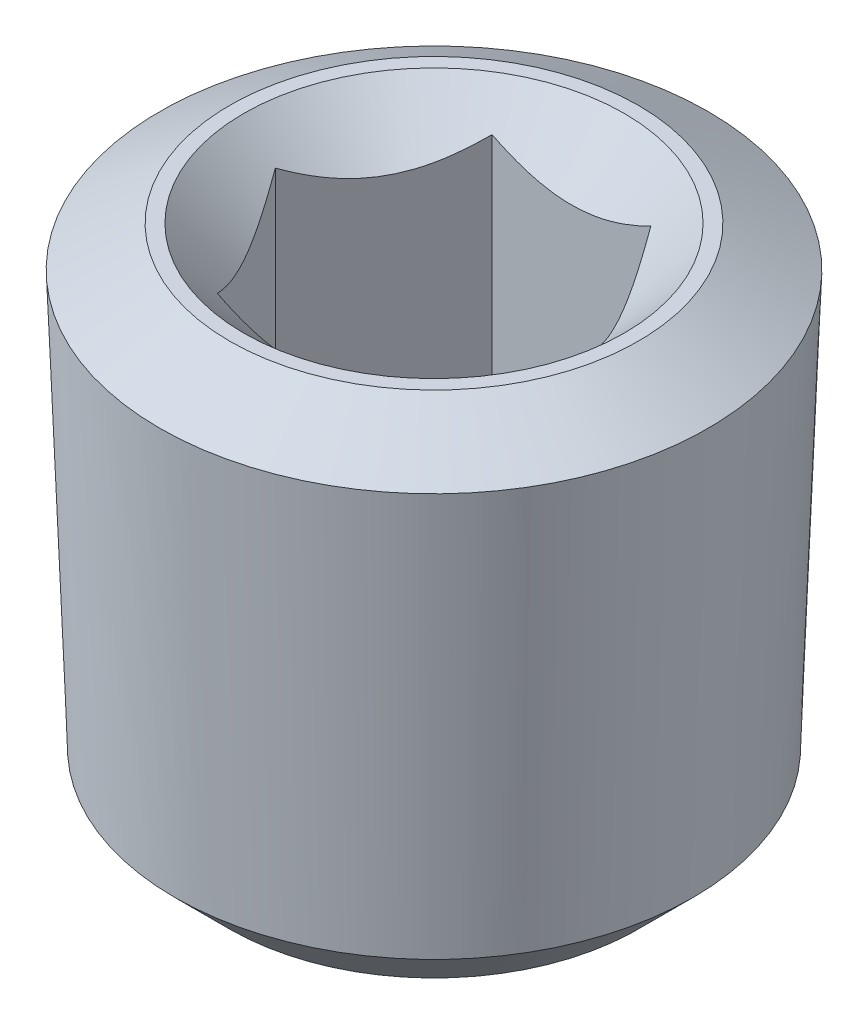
ISO-10303-21;
HEADER;
FILE_DESCRIPTION(('STEP AP214'),'2;1');
FILE_NAME('part.step','',(''),(''),'','','');
FILE_SCHEMA(('AUTOMOTIVE_DESIGN { 1 0 10303 214 1 1 1 1 }'));
ENDSEC;
DATA;
#1=APPLICATION_CONTEXT('core data for automotive mechanical design processes');
#2=APPLICATION_PROTOCOL_DEFINITION('international standard','automotive_design',2000,#1);
#3=PRODUCT_CONTEXT('',#1,'mechanical');
#4=PRODUCT('Part','Part','',(#3));
#5=PRODUCT_RELATED_PRODUCT_CATEGORY('part','',(#4));
#6=PRODUCT_DEFINITION_FORMATION('','',#4);
#7=PRODUCT_DEFINITION_CONTEXT('part definition',#1,'design');
#8=PRODUCT_DEFINITION('design','',#6,#7);
#9=PRODUCT_DEFINITION_SHAPE('','',#8);
#10=(LENGTH_UNIT() NAMED_UNIT(*) SI_UNIT(.MILLI.,.METRE.));
#11=(NAMED_UNIT(*) PLANE_ANGLE_UNIT() SI_UNIT($,.RADIAN.));
#12=(NAMED_UNIT(*) SI_UNIT($,.STERADIAN.) SOLID_ANGLE_UNIT());
#13=UNCERTAINTY_MEASURE_WITH_UNIT(LENGTH_MEASURE(1.E-05),#10,'distance_accuracy_value','');
#14=(GEOMETRIC_REPRESENTATION_CONTEXT(3) GLOBAL_UNCERTAINTY_ASSIGNED_CONTEXT((#13)) GLOBAL_UNIT_ASSIGNED_CONTEXT((#10,
#11,#12)) REPRESENTATION_CONTEXT('',''));
#15=CARTESIAN_POINT('',(0.,0.,0.));
#16=DIRECTION('',(0.,0.,1.));
#17=DIRECTION('',(1.,0.,0.));
#18=AXIS2_PLACEMENT_3D('',#15,#16,#17);
#19=CARTESIAN_POINT('',(0.,0.,0.));
#20=DIRECTION('',(0.,1.,0.));
#21=DIRECTION('',(0.,0.,1.));
#22=AXIS2_PLACEMENT_3D('',#19,#20,#21);
#23=PLANE('',#22);
#24=CARTESIAN_POINT('',(0.,0.,0.));
#25=DIRECTION('',(0.,1.,0.));
#26=DIRECTION('',(0.,0.,1.));
#27=AXIS2_PLACEMENT_3D('',#24,#25,#26);
#28=CIRCLE('',#27,2.7432);
#29=CARTESIAN_POINT('',(0.,0.,2.7432));
#30=VERTEX_POINT('',#29);
#31=EDGE_CURVE('E245',#30,#30,#28,.T.);
#32=ORIENTED_EDGE('',*,*,#31,.F.);
#33=EDGE_LOOP('',(#32));
#34=FACE_BOUND('',#33,.T.);
#35=CARTESIAN_POINT('',(0.,0.,0.));
#36=DIRECTION('',(0.,1.,0.));
#37=DIRECTION('',(0.,0.,1.));
#38=AXIS2_PLACEMENT_3D('',#35,#36,#37);
#39=CIRCLE('',#38,2.94547188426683);
#40=CARTESIAN_POINT('',(0.,0.,2.94547188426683));
#41=VERTEX_POINT('',#40);
#42=EDGE_CURVE('E12',#41,#41,#39,.T.);
#43=ORIENTED_EDGE('',*,*,#42,.T.);
#44=EDGE_LOOP('',(#43));
#45=FACE_BOUND('',#44,.T.);
#46=ADVANCED_FACE('F34',(#34,#45),#23,.T.);
#47=CARTESIAN_POINT('',(0.,0.,0.));
#48=DIRECTION('',(0.,-1.,0.));
#49=DIRECTION('',(0.,0.,-1.));
#50=AXIS2_PLACEMENT_3D('',#47,#48,#49);
#51=CONICAL_SURFACE('',#50,2.94547188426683,1.0471975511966);
#52=CARTESIAN_POINT('',(0.,-0.58220109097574,0.));
#53=DIRECTION('',(0.,1.,0.));
#54=DIRECTION('',(0.,0.,1.));
#55=AXIS2_PLACEMENT_3D('',#52,#53,#54);
#56=CIRCLE('',#55,3.95387375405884);
#57=CARTESIAN_POINT('',(0.,-0.58220109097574,3.95387375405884));
#58=VERTEX_POINT('',#57);
#59=EDGE_CURVE('E41',#58,#58,#56,.T.);
#60=ORIENTED_EDGE('',*,*,#59,.T.);
#61=EDGE_LOOP('',(#60));
#62=FACE_BOUND('',#61,.T.);
#63=ORIENTED_EDGE('',*,*,#42,.F.);
#64=EDGE_LOOP('',(#63));
#65=FACE_BOUND('',#64,.T.);
#66=ADVANCED_FACE('F235',(#62,#65),#51,.T.);
#67=CARTESIAN_POINT('',(0.,-0.58220109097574,0.));
#68=DIRECTION('',(0.,1.,0.));
#69=DIRECTION('',(0.,0.,1.));
#70=AXIS2_PLACEMENT_3D('',#67,#68,#69);
#71=CONICAL_SURFACE('',#70,3.95387375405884,0.0364424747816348);
#72=CARTESIAN_POINT('',(0.,-6.54976733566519,0.));
#73=DIRECTION('',(0.,1.,0.));
#74=DIRECTION('',(0.,0.,1.));
#75=AXIS2_PLACEMENT_3D('',#72,#73,#74);
#76=CIRCLE('',#75,3.73630454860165);
#77=CARTESIAN_POINT('',(0.,-6.54976733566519,3.73630454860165));
#78=VERTEX_POINT('',#77);
#79=EDGE_CURVE('E253',#78,#78,#76,.T.);
#80=ORIENTED_EDGE('',*,*,#79,.T.);
#81=EDGE_LOOP('',(#80));
#82=FACE_BOUND('',#81,.T.);
#83=ORIENTED_EDGE('',*,*,#59,.F.);
#84=EDGE_LOOP('',(#83));
#85=FACE_BOUND('',#84,.T.);
#86=ADVANCED_FACE('F240',(#82,#85),#71,.T.);
#87=CARTESIAN_POINT('',(0.,-6.54976733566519,0.));
#88=DIRECTION('',(0.,1.,0.));
#89=DIRECTION('',(0.,0.,1.));
#90=AXIS2_PLACEMENT_3D('',#87,#88,#89);
#91=CONICAL_SURFACE('',#90,3.73630454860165,0.785398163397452);
#92=CARTESIAN_POINT('',(0.,-7.3406,0.));
#93=DIRECTION('',(0.,1.,0.));
#94=DIRECTION('',(0.,0.,1.));
#95=AXIS2_PLACEMENT_3D('',#92,#93,#94);
#96=CIRCLE('',#95,2.94547188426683);
#97=CARTESIAN_POINT('',(0.,-7.3406,2.94547188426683));
#98=VERTEX_POINT('',#97);
#99=EDGE_CURVE('E249',#98,#98,#96,.T.);
#100=ORIENTED_EDGE('',*,*,#99,.T.);
#101=EDGE_LOOP('',(#100));
#102=FACE_BOUND('',#101,.T.);
#103=ORIENTED_EDGE('',*,*,#79,.F.);
#104=EDGE_LOOP('',(#103));
#105=FACE_BOUND('',#104,.T.);
#106=ADVANCED_FACE('F264',(#102,#105),#91,.T.);
#107=CARTESIAN_POINT('',(-2.94547188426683,-7.3406,0.));
#108=DIRECTION('',(0.,-1.,0.));
#109=DIRECTION('',(0.,0.,-1.));
#110=AXIS2_PLACEMENT_3D('',#107,#108,#109);
#111=PLANE('',#110);
#112=ORIENTED_EDGE('',*,*,#99,.F.);
#113=EDGE_LOOP('',(#112));
#114=FACE_BOUND('',#113,.T.);
#115=ADVANCED_FACE('F178',(#114),#111,.T.);
#116=CARTESIAN_POINT('',(0.,0.,0.));
#117=DIRECTION('',(0.,1.,0.));
#118=DIRECTION('',(0.,0.,1.));
#119=AXIS2_PLACEMENT_3D('',#116,#117,#118);
#120=CONICAL_SURFACE('',#119,2.7432,0.785398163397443);
#121=CARTESIAN_POINT('',(-2.57510355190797,0.50584782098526,1.9812));
#122=CARTESIAN_POINT('',(-2.51354578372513,0.457069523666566,1.9812));
#123=CARTESIAN_POINT('',(-2.45167860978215,0.408675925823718,1.9812));
#124=CARTESIAN_POINT('',(-2.32719174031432,0.312839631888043,1.9812));
#125=CARTESIAN_POINT('',(-2.26457188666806,0.265397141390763,1.9812));
#126=CARTESIAN_POINT('',(-2.13799293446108,0.171309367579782,1.9812));
#127=CARTESIAN_POINT('',(-2.07402727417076,0.124672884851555,1.9812));
#128=CARTESIAN_POINT('',(-1.94507265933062,0.03284224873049,1.9812));
#129=CARTESIAN_POINT('',(-1.88008377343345,-0.0123520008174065,1.9812));
#130=CARTESIAN_POINT('',(-1.74397621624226,-0.10427974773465,1.9812));
#131=CARTESIAN_POINT('',(-1.67276336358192,-0.150874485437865,1.9812));
#132=CARTESIAN_POINT('',(-1.52868136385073,-0.241424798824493,1.9812));
#133=CARTESIAN_POINT('',(-1.45581242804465,-0.285380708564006,1.9812));
#134=CARTESIAN_POINT('',(-1.30832056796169,-0.369762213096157,1.9812));
#135=CARTESIAN_POINT('',(-1.23370327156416,-0.410197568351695,1.9812));
#136=CARTESIAN_POINT('',(-1.08224421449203,-0.486624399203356,1.9812));
#137=CARTESIAN_POINT('',(-1.00540359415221,-0.522618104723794,1.9812));
#138=CARTESIAN_POINT('',(-0.859075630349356,-0.584647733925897,1.9812));
#139=CARTESIAN_POINT('',(-0.789880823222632,-0.611366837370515,1.9812));
#140=CARTESIAN_POINT('',(-0.649566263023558,-0.659274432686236,1.9812));
#141=CARTESIAN_POINT('',(-0.578446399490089,-0.68046260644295,1.9812));
#142=CARTESIAN_POINT('',(-0.436050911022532,-0.715727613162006,1.9812));
#143=CARTESIAN_POINT('',(-0.36481123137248,-0.729947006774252,1.9812));
#144=CARTESIAN_POINT('',(-0.221237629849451,-0.750948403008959,1.9812));
#145=CARTESIAN_POINT('',(-0.14890402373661,-0.757732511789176,1.9812));
#146=CARTESIAN_POINT('',(-0.00820637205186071,-0.76315624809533,1.9812));
#147=CARTESIAN_POINT('',(0.0601400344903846,-0.762252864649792,1.9812));
#148=CARTESIAN_POINT('',(0.196377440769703,-0.753452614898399,1.9812));
#149=CARTESIAN_POINT('',(0.264268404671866,-0.745555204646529,1.9812));
#150=CARTESIAN_POINT('',(0.400266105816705,-0.723106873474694,1.9812));
#151=CARTESIAN_POINT('',(0.468351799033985,-0.708430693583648,1.9812));
#152=CARTESIAN_POINT('',(0.602982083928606,-0.673292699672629,1.9812));
#153=CARTESIAN_POINT('',(0.669526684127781,-0.652830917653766,1.9812));
#154=CARTESIAN_POINT('',(0.867724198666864,-0.583887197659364,1.9812));
#155=CARTESIAN_POINT('',(0.996810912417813,-0.528063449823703,1.9812));
#156=CARTESIAN_POINT('',(1.2489899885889,-0.403752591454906,1.9812));
#157=CARTESIAN_POINT('',(1.3720599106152,-0.335222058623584,1.9812));
#158=CARTESIAN_POINT('',(1.54997195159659,-0.228144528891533,1.9812));
#159=CARTESIAN_POINT('',(1.60673701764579,-0.192728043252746,1.9812));
#160=CARTESIAN_POINT('',(1.71929230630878,-0.12036693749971,1.9812));
#161=CARTESIAN_POINT('',(1.77508245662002,-0.0834222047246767,1.9812));
#162=CARTESIAN_POINT('',(1.88537126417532,-0.00857930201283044,1.9812));
#163=CARTESIAN_POINT('',(1.93987664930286,0.0293090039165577,1.9812));
#164=CARTESIAN_POINT('',(2.04813768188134,0.106112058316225,1.9812));
#165=CARTESIAN_POINT('',(2.10189353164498,0.145026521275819,1.9812));
#166=CARTESIAN_POINT('',(2.15533457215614,0.184362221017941,1.9812));
#167=B_SPLINE_CURVE_WITH_KNOTS('',3,(#121,#122,#123,#124,#125,#126,#127,#128,#129,#130,#131,
#132,#133,#134,#135,#136,#137,#138,#139,#140,#141,#142,#143,#144,#145,#146,#147,#148,#149,#150,
#151,#152,#153,#154,#155,#156,#157,#158,#159,#160,#161,#162,#163,#164,#165,#166),.UNSPECIFIED.,
.F.,.F.,(4,2,2,2,2,2,2,2,2,2,2,2,2,2,2,2,2,2,2,2,2,2,4),(0.,0.235626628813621,0.471303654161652,
0.708772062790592,0.946224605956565,1.20148543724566,1.4567138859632,1.71121056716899,
1.9655789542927,2.18791541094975,2.41026465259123,2.62785270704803,2.84537911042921,
3.05006908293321,3.25477497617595,3.46342485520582,3.67207358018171,4.09278433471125,
4.51496018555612,4.71566341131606,4.91638145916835,5.11551042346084,5.31458455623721),.UNSPECIFIED.);
#168=CARTESIAN_POINT('',(1.14384635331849,-0.455507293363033,1.9812));
#169=VERTEX_POINT('',#168);
#170=CARTESIAN_POINT('',(-1.14384635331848,-0.455507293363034,1.9812));
#171=VERTEX_POINT('',#170);
#172=EDGE_CURVE('E48',#169,#171,#167,.F.);
#173=ORIENTED_EDGE('',*,*,#172,.T.);
#174=CARTESIAN_POINT('',(-1.14373088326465,-0.455391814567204,1.9814));
#175=CARTESIAN_POINT('',(-1.18305240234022,-0.494681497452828,1.91329313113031));
#176=CARTESIAN_POINT('',(-1.22303144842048,-0.531663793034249,1.84404739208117));
#177=CARTESIAN_POINT('',(-1.30455323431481,-0.599377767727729,1.70284751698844));
#178=CARTESIAN_POINT('',(-1.34610372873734,-0.630071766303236,1.63087994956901));
#179=CARTESIAN_POINT('',(-1.4298883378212,-0.682651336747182,1.48576074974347));
#180=CARTESIAN_POINT('',(-1.47210111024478,-0.704669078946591,1.41264608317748));
#181=CARTESIAN_POINT('',(-1.55745605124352,-0.738592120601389,1.26480698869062));
#182=CARTESIAN_POINT('',(-1.60059561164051,-0.750522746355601,1.19008707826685));
#183=CARTESIAN_POINT('',(-1.67494288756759,-0.761287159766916,1.0613138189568));
#184=CARTESIAN_POINT('',(-1.70605452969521,-0.762880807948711,1.00742687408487));
#185=CARTESIAN_POINT('',(-1.76822697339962,-0.760197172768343,0.899741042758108));
#186=CARTESIAN_POINT('',(-1.7992877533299,-0.755917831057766,0.845942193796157));
#187=CARTESIAN_POINT('',(-1.86111604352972,-0.741731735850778,0.738852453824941));
#188=CARTESIAN_POINT('',(-1.8918831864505,-0.731818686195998,0.685562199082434));
#189=CARTESIAN_POINT('',(-1.95288543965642,-0.706909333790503,0.579903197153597));
#190=CARTESIAN_POINT('',(-1.98312059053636,-0.691913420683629,0.527534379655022));
#191=CARTESIAN_POINT('',(-2.06057049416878,-0.647391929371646,0.393387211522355));
#192=CARTESIAN_POINT('',(-2.10730489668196,-0.6145094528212,0.312440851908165));
#193=CARTESIAN_POINT('',(-2.17602360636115,-0.558998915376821,0.19341655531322));
#194=CARTESIAN_POINT('',(-2.19866947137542,-0.539495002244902,0.154192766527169));
#195=CARTESIAN_POINT('',(-2.24354167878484,-0.498709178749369,0.0764718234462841));
#196=CARTESIAN_POINT('',(-2.26576826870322,-0.477428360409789,0.0379742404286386));
#197=CARTESIAN_POINT('',(-2.28780817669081,-0.455391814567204,-0.000200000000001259));
#198=B_SPLINE_CURVE_WITH_KNOTS('',3,(#174,#175,#176,#177,#178,#179,#180,#181,#182,#183,#184,
#185,#186,#187,#188,#189,#190,#191,#192,#193,#194,#195,#196,#197),.UNSPECIFIED.,.F.,.F.,(4,2,2,
2,2,2,2,2,2,2,2,4),(0.,0.263916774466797,0.529371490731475,0.79060967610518,1.05118999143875,
1.23765676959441,1.42418891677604,1.61092994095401,1.79765665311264,2.09428646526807,
2.24219924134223,2.39002177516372),.UNSPECIFIED.);
#199=CARTESIAN_POINT('',(-2.28769270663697,-0.455507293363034,0.));
#200=VERTEX_POINT('',#199);
#201=EDGE_CURVE('E120',#171,#200,#198,.T.);
#202=ORIENTED_EDGE('',*,*,#201,.T.);
#203=CARTESIAN_POINT('',(-2.28780817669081,-0.455391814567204,0.000199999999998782));
#204=CARTESIAN_POINT('',(-2.24848665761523,-0.494681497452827,-0.0679068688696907));
#205=CARTESIAN_POINT('',(-2.20850761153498,-0.531663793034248,-0.137152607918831));
#206=CARTESIAN_POINT('',(-2.12698582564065,-0.599377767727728,-0.278352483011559));
#207=CARTESIAN_POINT('',(-2.08543533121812,-0.630071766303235,-0.350320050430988));
#208=CARTESIAN_POINT('',(-2.00165072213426,-0.682651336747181,-0.495439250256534));
#209=CARTESIAN_POINT('',(-1.95943794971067,-0.704669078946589,-0.568553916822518));
#210=CARTESIAN_POINT('',(-1.87408300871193,-0.738592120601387,-0.71639301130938));
#211=CARTESIAN_POINT('',(-1.83094344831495,-0.7505227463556,-0.791112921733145));
#212=CARTESIAN_POINT('',(-1.75659617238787,-0.761287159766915,-0.919886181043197));
#213=CARTESIAN_POINT('',(-1.72548453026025,-0.762880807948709,-0.973773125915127));
#214=CARTESIAN_POINT('',(-1.66331208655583,-0.760197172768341,-1.08145895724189));
#215=CARTESIAN_POINT('',(-1.63225130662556,-0.755917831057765,-1.13525780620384));
#216=CARTESIAN_POINT('',(-1.57042301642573,-0.741731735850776,-1.24234754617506));
#217=CARTESIAN_POINT('',(-1.53965587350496,-0.731818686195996,-1.29563780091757));
#218=CARTESIAN_POINT('',(-1.47865362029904,-0.706909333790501,-1.4012968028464));
#219=CARTESIAN_POINT('',(-1.4484184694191,-0.691913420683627,-1.45366562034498));
#220=CARTESIAN_POINT('',(-1.37096856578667,-0.647391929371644,-1.58781278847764));
#221=CARTESIAN_POINT('',(-1.3242341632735,-0.614509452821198,-1.66875914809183));
#222=CARTESIAN_POINT('',(-1.2555154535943,-0.55899891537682,-1.78778344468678));
#223=CARTESIAN_POINT('',(-1.23286958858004,-0.5394950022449,-1.82700723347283));
#224=CARTESIAN_POINT('',(-1.18799738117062,-0.498709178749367,-1.90472817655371));
#225=CARTESIAN_POINT('',(-1.16577079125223,-0.477428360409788,-1.94322575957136));
#226=CARTESIAN_POINT('',(-1.14373088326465,-0.455391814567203,-1.9814));
#227=B_SPLINE_CURVE_WITH_KNOTS('',3,(#203,#204,#205,#206,#207,#208,#209,#210,#211,#212,#213,
#214,#215,#216,#217,#218,#219,#220,#221,#222,#223,#224,#225,#226),.UNSPECIFIED.,.F.,.F.,(4,2,2,
2,2,2,2,2,2,2,2,4),(0.,0.263916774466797,0.529371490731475,0.790609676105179,1.05118999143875,
1.23765676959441,1.42418891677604,1.61092994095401,1.79765665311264,2.09428646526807,
2.24219924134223,2.39002177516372),.UNSPECIFIED.);
#228=CARTESIAN_POINT('',(-1.14384635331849,-0.455507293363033,-1.9812));
#229=VERTEX_POINT('',#228);
#230=EDGE_CURVE('E202',#200,#229,#227,.T.);
#231=ORIENTED_EDGE('',*,*,#230,.T.);
#232=CARTESIAN_POINT('',(-2.57510355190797,0.505847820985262,-1.9812));
#233=CARTESIAN_POINT('',(-2.51354578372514,0.457069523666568,-1.9812));
#234=CARTESIAN_POINT('',(-2.45167860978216,0.40867592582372,-1.9812));
#235=CARTESIAN_POINT('',(-2.32719174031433,0.312839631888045,-1.9812));
#236=CARTESIAN_POINT('',(-2.26457188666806,0.265397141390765,-1.9812));
#237=CARTESIAN_POINT('',(-2.13799293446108,0.171309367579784,-1.9812));
#238=CARTESIAN_POINT('',(-2.07402727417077,0.124672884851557,-1.9812));
#239=CARTESIAN_POINT('',(-1.94507265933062,0.0328422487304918,-1.9812));
#240=CARTESIAN_POINT('',(-1.88008377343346,-0.0123520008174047,-1.9812));
#241=CARTESIAN_POINT('',(-1.74397621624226,-0.104279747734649,-1.9812));
#242=CARTESIAN_POINT('',(-1.67276336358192,-0.150874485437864,-1.9812));
#243=CARTESIAN_POINT('',(-1.52868136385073,-0.241424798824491,-1.9812));
#244=CARTESIAN_POINT('',(-1.45581242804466,-0.285380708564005,-1.9812));
#245=CARTESIAN_POINT('',(-1.30832056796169,-0.369762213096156,-1.9812));
#246=CARTESIAN_POINT('',(-1.23370327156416,-0.410197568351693,-1.9812));
#247=CARTESIAN_POINT('',(-1.08224421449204,-0.486624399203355,-1.9812));
#248=CARTESIAN_POINT('',(-1.00540359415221,-0.522618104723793,-1.9812));
#249=CARTESIAN_POINT('',(-0.859075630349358,-0.584647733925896,-1.9812));
#250=CARTESIAN_POINT('',(-0.789880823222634,-0.611366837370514,-1.9812));
#251=CARTESIAN_POINT('',(-0.649566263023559,-0.659274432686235,-1.9812));
#252=CARTESIAN_POINT('',(-0.57844639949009,-0.68046260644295,-1.9812));
#253=CARTESIAN_POINT('',(-0.436050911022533,-0.715727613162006,-1.9812));
#254=CARTESIAN_POINT('',(-0.364811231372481,-0.729947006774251,-1.9812));
#255=CARTESIAN_POINT('',(-0.221237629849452,-0.750948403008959,-1.9812));
#256=CARTESIAN_POINT('',(-0.148904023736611,-0.757732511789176,-1.9812));
#257=CARTESIAN_POINT('',(-0.00820637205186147,-0.76315624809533,-1.9812));
#258=CARTESIAN_POINT('',(0.060140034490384,-0.762252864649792,-1.9812));
#259=CARTESIAN_POINT('',(0.196377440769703,-0.753452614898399,-1.9812));
#260=CARTESIAN_POINT('',(0.264268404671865,-0.745555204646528,-1.9812));
#261=CARTESIAN_POINT('',(0.400266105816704,-0.723106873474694,-1.9812));
#262=CARTESIAN_POINT('',(0.468351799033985,-0.708430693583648,-1.9812));
#263=CARTESIAN_POINT('',(0.602982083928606,-0.673292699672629,-1.9812));
#264=CARTESIAN_POINT('',(0.669526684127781,-0.652830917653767,-1.9812));
#265=CARTESIAN_POINT('',(0.867724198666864,-0.583887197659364,-1.9812));
#266=CARTESIAN_POINT('',(0.996810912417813,-0.528063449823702,-1.9812));
#267=CARTESIAN_POINT('',(1.2489899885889,-0.403752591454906,-1.9812));
#268=CARTESIAN_POINT('',(1.3720599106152,-0.335222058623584,-1.9812));
#269=CARTESIAN_POINT('',(1.54997195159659,-0.228144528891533,-1.9812));
#270=CARTESIAN_POINT('',(1.60673701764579,-0.192728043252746,-1.9812));
#271=CARTESIAN_POINT('',(1.71929230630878,-0.120366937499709,-1.9812));
#272=CARTESIAN_POINT('',(1.77508245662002,-0.0834222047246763,-1.9812));
#273=CARTESIAN_POINT('',(1.88537126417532,-0.00857930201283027,-1.9812));
#274=CARTESIAN_POINT('',(1.93987664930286,0.0293090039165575,-1.9812));
#275=CARTESIAN_POINT('',(2.04813768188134,0.106112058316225,-1.9812));
#276=CARTESIAN_POINT('',(2.10189353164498,0.145026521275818,-1.9812));
#277=CARTESIAN_POINT('',(2.15533457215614,0.18436222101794,-1.9812));
#278=B_SPLINE_CURVE_WITH_KNOTS('',3,(#232,#233,#234,#235,#236,#237,#238,#239,#240,#241,#242,
#243,#244,#245,#246,#247,#248,#249,#250,#251,#252,#253,#254,#255,#256,#257,#258,#259,#260,#261,
#262,#263,#264,#265,#266,#267,#268,#269,#270,#271,#272,#273,#274,#275,#276,#277),.UNSPECIFIED.,
.F.,.F.,(4,2,2,2,2,2,2,2,2,2,2,2,2,2,2,2,2,2,2,2,2,2,4),(0.,0.235626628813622,0.471303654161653,
0.708772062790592,0.946224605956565,1.20148543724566,1.4567138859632,1.71121056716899,
1.96557895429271,2.18791541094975,2.41026465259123,2.62785270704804,2.84537911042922,
3.05006908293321,3.25477497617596,3.46342485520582,3.67207358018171,4.09278433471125,
4.51496018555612,4.71566341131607,4.91638145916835,5.11551042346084,5.31458455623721),.UNSPECIFIED.);
#279=CARTESIAN_POINT('',(1.14384635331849,-0.455507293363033,-1.9812));
#280=VERTEX_POINT('',#279);
#281=EDGE_CURVE('E195',#229,#280,#278,.T.);
#282=ORIENTED_EDGE('',*,*,#281,.T.);
#283=CARTESIAN_POINT('',(1.14373088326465,-0.455391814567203,-1.9814));
#284=CARTESIAN_POINT('',(1.18305240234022,-0.494681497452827,-1.91329313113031));
#285=CARTESIAN_POINT('',(1.22303144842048,-0.531663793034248,-1.84404739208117));
#286=CARTESIAN_POINT('',(1.30455323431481,-0.599377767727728,-1.70284751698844));
#287=CARTESIAN_POINT('',(1.34610372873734,-0.630071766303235,-1.63087994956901));
#288=CARTESIAN_POINT('',(1.4298883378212,-0.682651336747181,-1.48576074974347));
#289=CARTESIAN_POINT('',(1.47210111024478,-0.704669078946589,-1.41264608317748));
#290=CARTESIAN_POINT('',(1.55745605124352,-0.738592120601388,-1.26480698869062));
#291=CARTESIAN_POINT('',(1.60059561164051,-0.7505227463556,-1.19008707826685));
#292=CARTESIAN_POINT('',(1.67494288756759,-0.761287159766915,-1.0613138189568));
#293=CARTESIAN_POINT('',(1.70605452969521,-0.762880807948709,-1.00742687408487));
#294=CARTESIAN_POINT('',(1.76822697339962,-0.760197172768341,-0.899741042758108));
#295=CARTESIAN_POINT('',(1.7992877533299,-0.755917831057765,-0.845942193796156));
#296=CARTESIAN_POINT('',(1.86111604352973,-0.741731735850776,-0.73885245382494));
#297=CARTESIAN_POINT('',(1.8918831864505,-0.731818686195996,-0.685562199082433));
#298=CARTESIAN_POINT('',(1.95288543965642,-0.706909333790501,-0.579903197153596));
#299=CARTESIAN_POINT('',(1.98312059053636,-0.691913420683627,-0.527534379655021));
#300=CARTESIAN_POINT('',(2.06057049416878,-0.647391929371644,-0.393387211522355));
#301=CARTESIAN_POINT('',(2.10730489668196,-0.614509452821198,-0.312440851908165));
#302=CARTESIAN_POINT('',(2.17602360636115,-0.55899891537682,-0.193416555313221));
#303=CARTESIAN_POINT('',(2.19866947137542,-0.539495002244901,-0.154192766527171));
#304=CARTESIAN_POINT('',(2.24354167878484,-0.498709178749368,-0.0764718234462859));
#305=CARTESIAN_POINT('',(2.26576826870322,-0.477428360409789,-0.0379742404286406));
#306=CARTESIAN_POINT('',(2.28780817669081,-0.455391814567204,0.000199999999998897));
#307=B_SPLINE_CURVE_WITH_KNOTS('',3,(#283,#284,#285,#286,#287,#288,#289,#290,#291,#292,#293,
#294,#295,#296,#297,#298,#299,#300,#301,#302,#303,#304,#305,#306),.UNSPECIFIED.,.F.,.F.,(4,2,2,
2,2,2,2,2,2,2,2,4),(0.,0.263916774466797,0.529371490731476,0.790609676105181,1.05118999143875,
1.23765676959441,1.42418891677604,1.61092994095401,1.79765665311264,2.09428646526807,
2.24219924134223,2.39002177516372),.UNSPECIFIED.);
#308=CARTESIAN_POINT('',(2.28769270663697,-0.455507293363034,0.));
#309=VERTEX_POINT('',#308);
#310=EDGE_CURVE('E188',#280,#309,#307,.T.);
#311=ORIENTED_EDGE('',*,*,#310,.T.);
#312=CARTESIAN_POINT('',(2.28780817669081,-0.455391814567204,-0.0002000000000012));
#313=CARTESIAN_POINT('',(2.24848665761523,-0.494681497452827,0.0679068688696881));
#314=CARTESIAN_POINT('',(2.20850761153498,-0.531663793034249,0.137152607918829));
#315=CARTESIAN_POINT('',(2.12698582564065,-0.599377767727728,0.278352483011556));
#316=CARTESIAN_POINT('',(2.08543533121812,-0.630071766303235,0.350320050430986));
#317=CARTESIAN_POINT('',(2.00165072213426,-0.682651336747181,0.495439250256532));
#318=CARTESIAN_POINT('',(1.95943794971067,-0.70466907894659,0.568553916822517));
#319=CARTESIAN_POINT('',(1.87408300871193,-0.738592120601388,0.716393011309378));
#320=CARTESIAN_POINT('',(1.83094344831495,-0.7505227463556,0.791112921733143));
#321=CARTESIAN_POINT('',(1.75659617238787,-0.761287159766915,0.919886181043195));
#322=CARTESIAN_POINT('',(1.72548453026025,-0.76288080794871,0.973773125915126));
#323=CARTESIAN_POINT('',(1.66331208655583,-0.760197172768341,1.08145895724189));
#324=CARTESIAN_POINT('',(1.63225130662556,-0.755917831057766,1.13525780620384));
#325=CARTESIAN_POINT('',(1.57042301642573,-0.741731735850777,1.24234754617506));
#326=CARTESIAN_POINT('',(1.53965587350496,-0.731818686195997,1.29563780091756));
#327=CARTESIAN_POINT('',(1.47865362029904,-0.706909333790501,1.4012968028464));
#328=CARTESIAN_POINT('',(1.44841846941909,-0.691913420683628,1.45366562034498));
#329=CARTESIAN_POINT('',(1.37096856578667,-0.647391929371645,1.58781278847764));
#330=CARTESIAN_POINT('',(1.3242341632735,-0.614509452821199,1.66875914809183));
#331=CARTESIAN_POINT('',(1.2555154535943,-0.558998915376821,1.78778344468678));
#332=CARTESIAN_POINT('',(1.23286958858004,-0.539495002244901,1.82700723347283));
#333=CARTESIAN_POINT('',(1.18799738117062,-0.498709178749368,1.90472817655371));
#334=CARTESIAN_POINT('',(1.16577079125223,-0.477428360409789,1.94322575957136));
#335=CARTESIAN_POINT('',(1.14373088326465,-0.455391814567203,1.9814));
#336=B_SPLINE_CURVE_WITH_KNOTS('',3,(#312,#313,#314,#315,#316,#317,#318,#319,#320,#321,#322,
#323,#324,#325,#326,#327,#328,#329,#330,#331,#332,#333,#334,#335),.UNSPECIFIED.,.F.,.F.,(4,2,2,
2,2,2,2,2,2,2,2,4),(0.,0.263916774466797,0.529371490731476,0.79060967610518,1.05118999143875,
1.23765676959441,1.42418891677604,1.61092994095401,1.79765665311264,2.09428646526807,
2.24219924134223,2.39002177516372),.UNSPECIFIED.);
#337=EDGE_CURVE('E164',#309,#169,#336,.T.);
#338=ORIENTED_EDGE('',*,*,#337,.T.);
#339=EDGE_LOOP('',(#173,#202,#231,#282,#311,#338));
#340=FACE_BOUND('',#339,.T.);
#341=ORIENTED_EDGE('',*,*,#31,.T.);
#342=EDGE_LOOP('',(#341));
#343=FACE_BOUND('',#342,.T.);
#344=ADVANCED_FACE('F173',(#340,#343),#120,.F.);
#345=CARTESIAN_POINT('',(-2.28769270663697,-6.096,0.));
#346=DIRECTION('',(-0.866025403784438,0.,0.5));
#347=DIRECTION('',(0.5,0.,0.866025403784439));
#348=AXIS2_PLACEMENT_3D('',#345,#346,#347);
#349=PLANE('',#348);
#350=DIRECTION('',(0.,1.,0.));
#351=VECTOR('',#350,1.);
#352=CARTESIAN_POINT('',(-1.14384635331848,-6.096,1.9812));
#353=LINE('',#352,#351);
#354=CARTESIAN_POINT('',(-1.14384635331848,-6.096,1.9812));
#355=VERTEX_POINT('',#354);
#356=EDGE_CURVE('E117',#355,#171,#353,.T.);
#357=ORIENTED_EDGE('',*,*,#356,.F.);
#358=DIRECTION('',(0.5,0.,0.866025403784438));
#359=VECTOR('',#358,1.);
#360=CARTESIAN_POINT('',(-2.28769270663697,-6.096,0.));
#361=LINE('',#360,#359);
#362=CARTESIAN_POINT('',(-1.71576952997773,-6.096,0.990599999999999));
#363=VERTEX_POINT('',#362);
#364=EDGE_CURVE('E104',#363,#355,#361,.T.);
#365=ORIENTED_EDGE('',*,*,#364,.F.);
#366=CARTESIAN_POINT('',(-2.28769270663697,-6.096,0.));
#367=VERTEX_POINT('',#366);
#368=EDGE_CURVE('E114',#367,#363,#361,.T.);
#369=ORIENTED_EDGE('',*,*,#368,.F.);
#370=DIRECTION('',(0.,1.,0.));
#371=VECTOR('',#370,1.);
#372=CARTESIAN_POINT('',(-2.28769270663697,-6.096,0.));
#373=LINE('',#372,#371);
#374=EDGE_CURVE('E144',#367,#200,#373,.T.);
#375=ORIENTED_EDGE('',*,*,#374,.T.);
#376=ORIENTED_EDGE('',*,*,#201,.F.);
#377=EDGE_LOOP('',(#357,#365,#369,#375,#376));
#378=FACE_BOUND('',#377,.T.);
#379=ADVANCED_FACE('F118',(#378),#349,.F.);
#380=CARTESIAN_POINT('',(-1.14384635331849,-6.096,-1.9812));
#381=DIRECTION('',(-0.866025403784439,0.,-0.5));
#382=DIRECTION('',(-0.5,0.,0.866025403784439));
#383=AXIS2_PLACEMENT_3D('',#380,#381,#382);
#384=PLANE('',#383);
#385=ORIENTED_EDGE('',*,*,#374,.F.);
#386=DIRECTION('',(-0.5,0.,0.866025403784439));
#387=VECTOR('',#386,1.);
#388=CARTESIAN_POINT('',(-1.14384635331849,-6.096,-1.9812));
#389=LINE('',#388,#387);
#390=CARTESIAN_POINT('',(-1.71576952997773,-6.096,-0.990599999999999));
#391=VERTEX_POINT('',#390);
#392=EDGE_CURVE('E141',#391,#367,#389,.T.);
#393=ORIENTED_EDGE('',*,*,#392,.F.);
#394=CARTESIAN_POINT('',(-1.14384635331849,-6.096,-1.9812));
#395=VERTEX_POINT('',#394);
#396=EDGE_CURVE('E123',#395,#391,#389,.T.);
#397=ORIENTED_EDGE('',*,*,#396,.F.);
#398=DIRECTION('',(0.,1.,0.));
#399=VECTOR('',#398,1.);
#400=CARTESIAN_POINT('',(-1.14384635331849,-6.096,-1.9812));
#401=LINE('',#400,#399);
#402=EDGE_CURVE('E146',#395,#229,#401,.T.);
#403=ORIENTED_EDGE('',*,*,#402,.T.);
#404=ORIENTED_EDGE('',*,*,#230,.F.);
#405=EDGE_LOOP('',(#385,#393,#397,#403,#404));
#406=FACE_BOUND('',#405,.T.);
#407=ADVANCED_FACE('F213',(#406),#384,.F.);
#408=CARTESIAN_POINT('',(1.14384635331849,-6.096,-1.9812));
#409=DIRECTION('',(0.,0.,-1.));
#410=DIRECTION('',(-1.,0.,0.));
#411=AXIS2_PLACEMENT_3D('',#408,#409,#410);
#412=PLANE('',#411);
#413=ORIENTED_EDGE('',*,*,#402,.F.);
#414=DIRECTION('',(-1.,0.,0.));
#415=VECTOR('',#414,1.);
#416=CARTESIAN_POINT('',(1.14384635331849,-6.096,-1.9812));
#417=LINE('',#416,#415);
#418=CARTESIAN_POINT('',(0.,-6.096,-1.9812));
#419=VERTEX_POINT('',#418);
#420=EDGE_CURVE('E137',#419,#395,#417,.T.);
#421=ORIENTED_EDGE('',*,*,#420,.F.);
#422=CARTESIAN_POINT('',(1.14384635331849,-6.096,-1.9812));
#423=VERTEX_POINT('',#422);
#424=EDGE_CURVE('E138',#423,#419,#417,.T.);
#425=ORIENTED_EDGE('',*,*,#424,.F.);
#426=DIRECTION('',(0.,1.,0.));
#427=VECTOR('',#426,1.);
#428=CARTESIAN_POINT('',(1.14384635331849,-6.096,-1.9812));
#429=LINE('',#428,#427);
#430=EDGE_CURVE('E149',#423,#280,#429,.T.);
#431=ORIENTED_EDGE('',*,*,#430,.T.);
#432=ORIENTED_EDGE('',*,*,#281,.F.);
#433=EDGE_LOOP('',(#413,#421,#425,#431,#432));
#434=FACE_BOUND('',#433,.T.);
#435=ADVANCED_FACE('F217',(#434),#412,.F.);
#436=CARTESIAN_POINT('',(2.28769270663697,-6.096,0.));
#437=DIRECTION('',(0.866025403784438,0.,-0.5));
#438=DIRECTION('',(-0.5,0.,-0.866025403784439));
#439=AXIS2_PLACEMENT_3D('',#436,#437,#438);
#440=PLANE('',#439);
#441=ORIENTED_EDGE('',*,*,#430,.F.);
#442=DIRECTION('',(-0.5,0.,-0.866025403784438));
#443=VECTOR('',#442,1.);
#444=CARTESIAN_POINT('',(2.28769270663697,-6.096,0.));
#445=LINE('',#444,#443);
#446=CARTESIAN_POINT('',(1.71576952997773,-6.096,-0.9906));
#447=VERTEX_POINT('',#446);
#448=EDGE_CURVE('E133',#447,#423,#445,.T.);
#449=ORIENTED_EDGE('',*,*,#448,.F.);
#450=CARTESIAN_POINT('',(2.28769270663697,-6.096,0.));
#451=VERTEX_POINT('',#450);
#452=EDGE_CURVE('E134',#451,#447,#445,.T.);
#453=ORIENTED_EDGE('',*,*,#452,.F.);
#454=DIRECTION('',(0.,1.,0.));
#455=VECTOR('',#454,1.);
#456=CARTESIAN_POINT('',(2.28769270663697,-6.096,0.));
#457=LINE('',#456,#455);
#458=EDGE_CURVE('E152',#451,#309,#457,.T.);
#459=ORIENTED_EDGE('',*,*,#458,.T.);
#460=ORIENTED_EDGE('',*,*,#310,.F.);
#461=EDGE_LOOP('',(#441,#449,#453,#459,#460));
#462=FACE_BOUND('',#461,.T.);
#463=ADVANCED_FACE('F221',(#462),#440,.F.);
#464=CARTESIAN_POINT('',(1.14384635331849,-6.096,1.9812));
#465=DIRECTION('',(0.866025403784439,0.,0.5));
#466=DIRECTION('',(0.5,0.,-0.866025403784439));
#467=AXIS2_PLACEMENT_3D('',#464,#465,#466);
#468=PLANE('',#467);
#469=ORIENTED_EDGE('',*,*,#458,.F.);
#470=DIRECTION('',(0.5,0.,-0.866025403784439));
#471=VECTOR('',#470,1.);
#472=CARTESIAN_POINT('',(1.14384635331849,-6.096,1.9812));
#473=LINE('',#472,#471);
#474=CARTESIAN_POINT('',(1.71576952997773,-6.096,0.990599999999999));
#475=VERTEX_POINT('',#474);
#476=EDGE_CURVE('E129',#475,#451,#473,.T.);
#477=ORIENTED_EDGE('',*,*,#476,.F.);
#478=CARTESIAN_POINT('',(1.14384635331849,-6.096,1.9812));
#479=VERTEX_POINT('',#478);
#480=EDGE_CURVE('E56',#479,#475,#473,.T.);
#481=ORIENTED_EDGE('',*,*,#480,.F.);
#482=DIRECTION('',(0.,1.,0.));
#483=VECTOR('',#482,1.);
#484=CARTESIAN_POINT('',(1.14384635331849,-6.096,1.9812));
#485=LINE('',#484,#483);
#486=EDGE_CURVE('E122',#479,#169,#485,.T.);
#487=ORIENTED_EDGE('',*,*,#486,.T.);
#488=ORIENTED_EDGE('',*,*,#337,.F.);
#489=EDGE_LOOP('',(#469,#477,#481,#487,#488));
#490=FACE_BOUND('',#489,.T.);
#491=ADVANCED_FACE('F225',(#490),#468,.F.);
#492=CARTESIAN_POINT('',(-1.14384635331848,-6.096,1.9812));
#493=DIRECTION('',(0.,0.,1.));
#494=DIRECTION('',(1.,0.,0.));
#495=AXIS2_PLACEMENT_3D('',#492,#493,#494);
#496=PLANE('',#495);
#497=ORIENTED_EDGE('',*,*,#486,.F.);
#498=DIRECTION('',(1.,0.,0.));
#499=VECTOR('',#498,1.);
#500=CARTESIAN_POINT('',(-1.14384635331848,-6.096,1.9812));
#501=LINE('',#500,#499);
#502=CARTESIAN_POINT('',(0.,-6.096,1.9812));
#503=VERTEX_POINT('',#502);
#504=EDGE_CURVE('E128',#503,#479,#501,.T.);
#505=ORIENTED_EDGE('',*,*,#504,.F.);
#506=EDGE_CURVE('E108',#355,#503,#501,.T.);
#507=ORIENTED_EDGE('',*,*,#506,.F.);
#508=ORIENTED_EDGE('',*,*,#356,.T.);
#509=ORIENTED_EDGE('',*,*,#172,.F.);
#510=EDGE_LOOP('',(#497,#505,#507,#508,#509));
#511=FACE_BOUND('',#510,.T.);
#512=ADVANCED_FACE('F127',(#511),#496,.F.);
#513=CARTESIAN_POINT('',(0.,-6.096,0.));
#514=DIRECTION('',(0.,1.,0.));
#515=DIRECTION('',(0.,0.,1.));
#516=AXIS2_PLACEMENT_3D('',#513,#514,#515);
#517=PLANE('',#516);
#518=CARTESIAN_POINT('',(0.,-6.096,0.));
#519=DIRECTION('',(0.,1.,0.));
#520=DIRECTION('',(0.,0.,1.));
#521=AXIS2_PLACEMENT_3D('',#518,#519,#520);
#522=CIRCLE('',#521,1.9812);
#523=EDGE_CURVE('E110',#363,#503,#522,.T.);
#524=ORIENTED_EDGE('',*,*,#523,.F.);
#525=ORIENTED_EDGE('',*,*,#364,.T.);
#526=ORIENTED_EDGE('',*,*,#506,.T.);
#527=EDGE_LOOP('',(#524,#525,#526));
#528=FACE_BOUND('',#527,.T.);
#529=ADVANCED_FACE('F106',(#528),#517,.T.);
#530=EDGE_CURVE('E415',#391,#363,#522,.T.);
#531=ORIENTED_EDGE('',*,*,#530,.F.);
#532=ORIENTED_EDGE('',*,*,#392,.T.);
#533=ORIENTED_EDGE('',*,*,#368,.T.);
#534=EDGE_LOOP('',(#531,#532,#533));
#535=FACE_BOUND('',#534,.T.);
#536=ADVANCED_FACE('F321',(#535),#517,.T.);
#537=EDGE_CURVE('E426',#419,#391,#522,.T.);
#538=ORIENTED_EDGE('',*,*,#537,.F.);
#539=ORIENTED_EDGE('',*,*,#420,.T.);
#540=ORIENTED_EDGE('',*,*,#396,.T.);
#541=EDGE_LOOP('',(#538,#539,#540));
#542=FACE_BOUND('',#541,.T.);
#543=ADVANCED_FACE('F330',(#542),#517,.T.);
#544=EDGE_CURVE('E427',#447,#419,#522,.T.);
#545=ORIENTED_EDGE('',*,*,#544,.F.);
#546=ORIENTED_EDGE('',*,*,#448,.T.);
#547=ORIENTED_EDGE('',*,*,#424,.T.);
#548=EDGE_LOOP('',(#545,#546,#547));
#549=FACE_BOUND('',#548,.T.);
#550=ADVANCED_FACE('F339',(#549),#517,.T.);
#551=EDGE_CURVE('E256',#475,#447,#522,.T.);
#552=ORIENTED_EDGE('',*,*,#551,.F.);
#553=ORIENTED_EDGE('',*,*,#476,.T.);
#554=ORIENTED_EDGE('',*,*,#452,.T.);
#555=EDGE_LOOP('',(#552,#553,#554));
#556=FACE_BOUND('',#555,.T.);
#557=ADVANCED_FACE('F348',(#556),#517,.T.);
#558=EDGE_CURVE('E250',#503,#475,#522,.T.);
#559=ORIENTED_EDGE('',*,*,#558,.F.);
#560=ORIENTED_EDGE('',*,*,#504,.T.);
#561=ORIENTED_EDGE('',*,*,#480,.T.);
#562=EDGE_LOOP('',(#559,#560,#561));
#563=FACE_BOUND('',#562,.T.);
#564=ADVANCED_FACE('F322',(#563),#517,.T.);
#565=CARTESIAN_POINT('',(-1.55847301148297,-6.35,0.));
#566=DIRECTION('',(0.,-1.,0.));
#567=DIRECTION('',(0.,0.,-1.));
#568=AXIS2_PLACEMENT_3D('',#565,#566,#567);
#569=PLANE('',#568);
#570=CARTESIAN_POINT('',(0.,-6.35,0.));
#571=DIRECTION('',(0.,1.,0.));
#572=DIRECTION('',(0.,0.,1.));
#573=AXIS2_PLACEMENT_3D('',#570,#571,#572);
#574=CIRCLE('',#573,1.55847301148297);
#575=CARTESIAN_POINT('',(0.,-6.35,1.55847301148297));
#576=VERTEX_POINT('',#575);
#577=EDGE_CURVE('E414',#576,#576,#574,.T.);
#578=ORIENTED_EDGE('',*,*,#577,.T.);
#579=EDGE_LOOP('',(#578));
#580=FACE_BOUND('',#579,.T.);
#581=ADVANCED_FACE('F365',(#580),#569,.F.);
#582=CARTESIAN_POINT('',(0.,-6.096,0.));
#583=DIRECTION('',(0.,1.,0.));
#584=DIRECTION('',(0.,0.,1.));
#585=AXIS2_PLACEMENT_3D('',#582,#583,#584);
#586=CONICAL_SURFACE('',#585,1.9812,1.02974425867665);
#587=ORIENTED_EDGE('',*,*,#577,.F.);
#588=EDGE_LOOP('',(#587));
#589=FACE_BOUND('',#588,.T.);
#590=ORIENTED_EDGE('',*,*,#558,.T.);
#591=ORIENTED_EDGE('',*,*,#551,.T.);
#592=ORIENTED_EDGE('',*,*,#544,.T.);
#593=ORIENTED_EDGE('',*,*,#537,.T.);
#594=ORIENTED_EDGE('',*,*,#530,.T.);
#595=ORIENTED_EDGE('',*,*,#523,.T.);
#596=EDGE_LOOP('',(#590,#591,#592,#593,#594,#595));
#597=FACE_BOUND('',#596,.T.);
#598=ADVANCED_FACE('F179',(#589,#597),#586,.F.);
#599=CLOSED_SHELL('',(#46,#66,#86,#106,#115,#344,#379,#407,#435,#463,#491,#512,#529,#536,#543,
#550,#557,#564,#581,#598));
#600=MANIFOLD_SOLID_BREP('B2',#599);
#601=ADVANCED_BREP_SHAPE_REPRESENTATION('',(#18,#600),#14);
#602=SHAPE_DEFINITION_REPRESENTATION(#9,#601);
ENDSEC;
END-ISO-10303-21;
